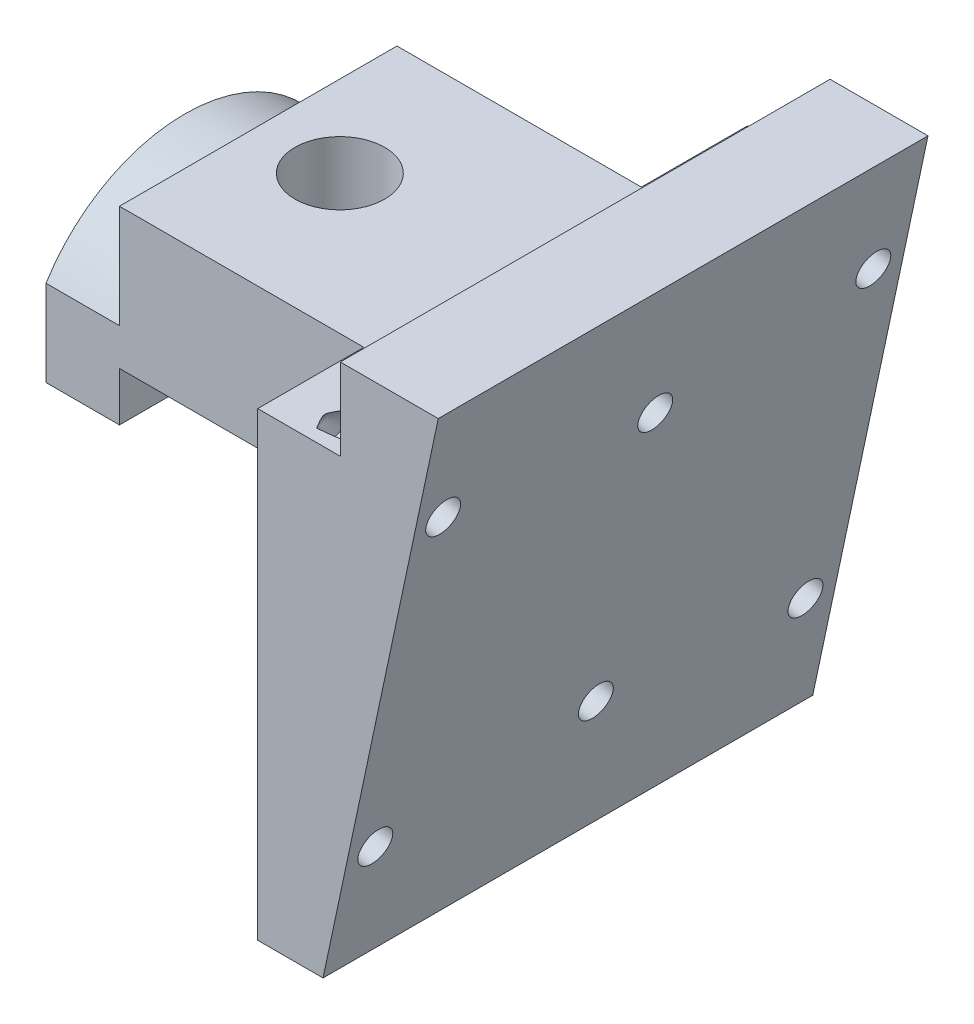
ISO-10303-21;
HEADER;
FILE_DESCRIPTION(('STEP AP214'),'2;1');
FILE_NAME('part.step','',(''),(''),'','','');
FILE_SCHEMA(('AUTOMOTIVE_DESIGN { 1 0 10303 214 1 1 1 1 }'));
ENDSEC;
DATA;
#1=APPLICATION_CONTEXT('core data for automotive mechanical design processes');
#2=APPLICATION_PROTOCOL_DEFINITION('international standard','automotive_design',2000,#1);
#3=PRODUCT_CONTEXT('',#1,'mechanical');
#4=PRODUCT('Part','Part','',(#3));
#5=PRODUCT_RELATED_PRODUCT_CATEGORY('part','',(#4));
#6=PRODUCT_DEFINITION_FORMATION('','',#4);
#7=PRODUCT_DEFINITION_CONTEXT('part definition',#1,'design');
#8=PRODUCT_DEFINITION('design','',#6,#7);
#9=PRODUCT_DEFINITION_SHAPE('','',#8);
#10=(LENGTH_UNIT() NAMED_UNIT(*) SI_UNIT(.MILLI.,.METRE.));
#11=(NAMED_UNIT(*) PLANE_ANGLE_UNIT() SI_UNIT($,.RADIAN.));
#12=(NAMED_UNIT(*) SI_UNIT($,.STERADIAN.) SOLID_ANGLE_UNIT());
#13=UNCERTAINTY_MEASURE_WITH_UNIT(LENGTH_MEASURE(1.E-05),#10,'distance_accuracy_value','');
#14=(GEOMETRIC_REPRESENTATION_CONTEXT(3) GLOBAL_UNCERTAINTY_ASSIGNED_CONTEXT((#13)) GLOBAL_UNIT_ASSIGNED_CONTEXT((#10,
#11,#12)) REPRESENTATION_CONTEXT('',''));
#15=CARTESIAN_POINT('',(0.,0.,0.));
#16=DIRECTION('',(0.,0.,1.));
#17=DIRECTION('',(1.,0.,0.));
#18=AXIS2_PLACEMENT_3D('',#15,#16,#17);
#19=CARTESIAN_POINT('',(106.058601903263,23.2081110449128,30.));
#20=DIRECTION('',(0.,-1.,0.));
#21=DIRECTION('',(0.,0.,-1.));
#22=AXIS2_PLACEMENT_3D('',#19,#20,#21);
#23=PLANE('',#22);
#24=CARTESIAN_POINT('',(76.,23.2081110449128,0.));
#25=DIRECTION('',(0.,1.,0.));
#26=DIRECTION('',(0.,0.,1.));
#27=AXIS2_PLACEMENT_3D('',#24,#25,#26);
#28=CIRCLE('',#27,5.49999999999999);
#29=CARTESIAN_POINT('',(76.,23.2081110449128,5.49999999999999));
#30=VERTEX_POINT('',#29);
#31=EDGE_CURVE('E330',#30,#30,#28,.T.);
#32=ORIENTED_EDGE('',*,*,#31,.F.);
#33=EDGE_LOOP('',(#32));
#34=FACE_BOUND('',#33,.T.);
#35=DIRECTION('',(0.,0.,-1.));
#36=VECTOR('',#35,1.);
#37=CARTESIAN_POINT('',(106.058601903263,23.2081110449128,30.));
#38=LINE('',#37,#36);
#39=CARTESIAN_POINT('',(106.058601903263,23.2081110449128,30.));
#40=VERTEX_POINT('',#39);
#41=CARTESIAN_POINT('',(106.058601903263,23.2081110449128,27.7685099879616));
#42=VERTEX_POINT('',#41);
#43=EDGE_CURVE('E186',#40,#42,#38,.T.);
#44=ORIENTED_EDGE('',*,*,#43,.T.);
#45=CARTESIAN_POINT('',(98.0091088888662,23.2081110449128,26.4999999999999));
#46=DIRECTION('',(0.,-1.,0.));
#47=DIRECTION('',(1.,0.,0.));
#48=AXIS2_PLACEMENT_3D('',#45,#46,#47);
#49=ELLIPSE('',#48,10.1004421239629,2.09999999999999);
#50=CARTESIAN_POINT('',(101.620267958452,23.2081110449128,28.4611976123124));
#51=VERTEX_POINT('',#50);
#52=EDGE_CURVE('E51',#42,#51,#49,.T.);
#53=ORIENTED_EDGE('',*,*,#52,.T.);
#54=CARTESIAN_POINT('',(101.703987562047,23.2081110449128,28.6001999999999));
#55=CARTESIAN_POINT('',(101.657498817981,23.2081110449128,28.5231351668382));
#56=CARTESIAN_POINT('',(101.611091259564,23.2081110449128,28.4460209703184));
#57=CARTESIAN_POINT('',(101.518463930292,23.2081110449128,28.2914900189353));
#58=CARTESIAN_POINT('',(101.472244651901,23.2081110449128,28.2140729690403));
#59=CARTESIAN_POINT('',(101.376601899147,23.2081110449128,28.0529698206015));
#60=CARTESIAN_POINT('',(101.327209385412,23.2081110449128,27.9692652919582));
#61=CARTESIAN_POINT('',(101.229229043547,23.2081110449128,27.8015944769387));
#62=CARTESIAN_POINT('',(101.180639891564,23.2081110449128,27.7176289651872));
#63=CARTESIAN_POINT('',(101.08481873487,23.2081110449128,27.5492901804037));
#64=CARTESIAN_POINT('',(101.037582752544,23.2081110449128,27.4649191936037));
#65=CARTESIAN_POINT('',(100.968346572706,23.2081110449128,27.3371563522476));
#66=CARTESIAN_POINT('',(100.945473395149,23.2081110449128,27.2942412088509));
#67=CARTESIAN_POINT('',(100.900614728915,23.2081110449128,27.2079516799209));
#68=CARTESIAN_POINT('',(100.878629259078,23.2081110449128,27.1645772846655));
#69=CARTESIAN_POINT('',(100.83702303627,23.2081110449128,27.0792265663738));
#70=CARTESIAN_POINT('',(100.817339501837,23.2081110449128,27.0372823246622));
#71=CARTESIAN_POINT('',(100.77990806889,23.2081110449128,26.9525477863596));
#72=CARTESIAN_POINT('',(100.762162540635,23.2081110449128,26.9097565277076));
#73=CARTESIAN_POINT('',(100.713956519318,23.2081110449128,26.7803247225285));
#74=CARTESIAN_POINT('',(100.687919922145,23.2081110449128,26.6915221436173));
#75=CARTESIAN_POINT('',(100.673384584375,23.2081110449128,26.5757783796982));
#76=CARTESIAN_POINT('',(100.671356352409,23.2081110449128,26.5506544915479));
#77=CARTESIAN_POINT('',(100.669725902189,23.2081110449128,26.5003077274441));
#78=CARTESIAN_POINT('',(100.670125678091,23.2081110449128,26.4750847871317));
#79=CARTESIAN_POINT('',(100.67331773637,23.2081110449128,26.4247064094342));
#80=CARTESIAN_POINT('',(100.676118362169,23.2081110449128,26.3995515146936));
#81=CARTESIAN_POINT('',(100.683842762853,23.2081110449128,26.3495812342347));
#82=CARTESIAN_POINT('',(100.688766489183,23.2081110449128,26.3247658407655));
#83=CARTESIAN_POINT('',(100.703654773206,23.2081110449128,26.2614784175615));
#84=CARTESIAN_POINT('',(100.714891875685,23.2081110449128,26.2233101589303));
#85=CARTESIAN_POINT('',(100.740227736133,23.2081110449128,26.1479200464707));
#86=CARTESIAN_POINT('',(100.754330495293,23.2081110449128,26.1106995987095));
#87=CARTESIAN_POINT('',(100.784458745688,23.2081110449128,26.0368687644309));
#88=CARTESIAN_POINT('',(100.800492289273,23.2081110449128,26.000261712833));
#89=CARTESIAN_POINT('',(100.833797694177,23.2081110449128,25.9276474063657));
#90=CARTESIAN_POINT('',(100.8510688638,23.2081110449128,25.891639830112));
#91=CARTESIAN_POINT('',(100.905015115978,23.2081110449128,25.7824483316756));
#92=CARTESIAN_POINT('',(100.943022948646,23.2081110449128,25.7099273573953));
#93=CARTESIAN_POINT('',(101.020667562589,23.2081110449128,25.5660215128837));
#94=CARTESIAN_POINT('',(101.060299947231,23.2081110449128,25.4946342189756));
#95=CARTESIAN_POINT('',(101.150225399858,23.2081110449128,25.3352895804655));
#96=CARTESIAN_POINT('',(101.200786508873,23.2081110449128,25.2474836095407));
#97=CARTESIAN_POINT('',(101.302790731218,23.2081110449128,25.0722837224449));
#98=CARTESIAN_POINT('',(101.354234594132,23.2081110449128,24.9848902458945));
#99=CARTESIAN_POINT('',(101.455262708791,23.2081110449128,24.81441440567));
#100=CARTESIAN_POINT('',(101.504823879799,23.2081110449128,24.7313183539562));
#101=CARTESIAN_POINT('',(101.604223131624,23.2081110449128,24.5653968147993));
#102=CARTESIAN_POINT('',(101.654060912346,23.2081110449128,24.4825711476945));
#103=CARTESIAN_POINT('',(101.703987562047,23.2081110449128,24.3997999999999));
#104=B_SPLINE_CURVE_WITH_KNOTS('',3,(#54,#55,#56,#57,#58,#59,#60,#61,#62,#63,#64,#65,#66,#67,
#68,#69,#70,#71,#72,#73,#74,#75,#76,#77,#78,#79,#80,#81,#82,#83,#84,#85,#86,#87,#88,#89,#90,#91,
#92,#93,#94,#95,#96,#97,#98,#99,#100,#101,#102,#103),.UNSPECIFIED.,.F.,.F.,(4,2,2,2,2,2,2,2,2,2,
2,2,2,2,2,2,2,2,2,2,2,2,2,2,4),(0.,0.270003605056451,0.540496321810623,0.83206650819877,
1.12309530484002,1.41315578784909,1.55903628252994,1.70491987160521,1.84384055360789,
1.9829292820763,2.25732169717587,2.33282083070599,2.40838198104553,2.4842067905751,
2.56002986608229,2.67920400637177,2.79854570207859,2.91840357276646,3.03819497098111,
3.28376658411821,3.5287125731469,3.83267008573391,4.1368999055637,4.42715979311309,
4.71714997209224),.UNSPECIFIED.);
#105=CARTESIAN_POINT('',(101.620267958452,23.2081110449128,24.5388023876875));
#106=VERTEX_POINT('',#105);
#107=EDGE_CURVE('E11',#51,#106,#104,.T.);
#108=ORIENTED_EDGE('',*,*,#107,.T.);
#109=CARTESIAN_POINT('',(106.058601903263,23.2081110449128,25.2314900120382));
#110=VERTEX_POINT('',#109);
#111=EDGE_CURVE('E183',#106,#110,#49,.T.);
#112=ORIENTED_EDGE('',*,*,#111,.T.);
#113=CARTESIAN_POINT('',(106.058601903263,23.2081110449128,-24.9314900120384));
#114=VERTEX_POINT('',#113);
#115=EDGE_CURVE('E59',#110,#114,#38,.T.);
#116=ORIENTED_EDGE('',*,*,#115,.T.);
#117=CARTESIAN_POINT('',(98.0091088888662,23.2081110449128,-26.2000000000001));
#118=DIRECTION('',(0.,-1.,0.));
#119=DIRECTION('',(1.,0.,0.));
#120=AXIS2_PLACEMENT_3D('',#117,#118,#119);
#121=ELLIPSE('',#120,10.1004421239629,2.09999999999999);
#122=CARTESIAN_POINT('',(101.620267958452,23.2081110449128,-24.2388023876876));
#123=VERTEX_POINT('',#122);
#124=EDGE_CURVE('E209',#114,#123,#121,.T.);
#125=ORIENTED_EDGE('',*,*,#124,.T.);
#126=CARTESIAN_POINT('',(101.703987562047,23.2081110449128,-24.0998000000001));
#127=CARTESIAN_POINT('',(101.657498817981,23.2081110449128,-24.1768648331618));
#128=CARTESIAN_POINT('',(101.611091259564,23.2081110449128,-24.2539790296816));
#129=CARTESIAN_POINT('',(101.518463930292,23.2081110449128,-24.4085099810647));
#130=CARTESIAN_POINT('',(101.472244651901,23.2081110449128,-24.4859270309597));
#131=CARTESIAN_POINT('',(101.376601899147,23.2081110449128,-24.6470301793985));
#132=CARTESIAN_POINT('',(101.327209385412,23.2081110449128,-24.7307347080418));
#133=CARTESIAN_POINT('',(101.229229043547,23.2081110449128,-24.8984055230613));
#134=CARTESIAN_POINT('',(101.180639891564,23.2081110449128,-24.9823710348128));
#135=CARTESIAN_POINT('',(101.08481873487,23.2081110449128,-25.1507098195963));
#136=CARTESIAN_POINT('',(101.037582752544,23.2081110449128,-25.2350808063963));
#137=CARTESIAN_POINT('',(100.968346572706,23.2081110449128,-25.3628436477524));
#138=CARTESIAN_POINT('',(100.945473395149,23.2081110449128,-25.4057587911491));
#139=CARTESIAN_POINT('',(100.900614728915,23.2081110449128,-25.4920483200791));
#140=CARTESIAN_POINT('',(100.878629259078,23.2081110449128,-25.5354227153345));
#141=CARTESIAN_POINT('',(100.83702303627,23.2081110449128,-25.6207734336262));
#142=CARTESIAN_POINT('',(100.817339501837,23.2081110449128,-25.6627176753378));
#143=CARTESIAN_POINT('',(100.77990806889,23.2081110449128,-25.7474522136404));
#144=CARTESIAN_POINT('',(100.762162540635,23.2081110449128,-25.7902434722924));
#145=CARTESIAN_POINT('',(100.713956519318,23.2081110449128,-25.9196752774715));
#146=CARTESIAN_POINT('',(100.687919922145,23.2081110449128,-26.0084778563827));
#147=CARTESIAN_POINT('',(100.673384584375,23.2081110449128,-26.1242216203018));
#148=CARTESIAN_POINT('',(100.671356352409,23.2081110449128,-26.1493455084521));
#149=CARTESIAN_POINT('',(100.669725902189,23.2081110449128,-26.1996922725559));
#150=CARTESIAN_POINT('',(100.670125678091,23.2081110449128,-26.2249152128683));
#151=CARTESIAN_POINT('',(100.67331773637,23.2081110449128,-26.2752935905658));
#152=CARTESIAN_POINT('',(100.676118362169,23.2081110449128,-26.3004484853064));
#153=CARTESIAN_POINT('',(100.683842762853,23.2081110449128,-26.3504187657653));
#154=CARTESIAN_POINT('',(100.688766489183,23.2081110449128,-26.3752341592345));
#155=CARTESIAN_POINT('',(100.703654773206,23.2081110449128,-26.4385215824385));
#156=CARTESIAN_POINT('',(100.714891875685,23.2081110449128,-26.4766898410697));
#157=CARTESIAN_POINT('',(100.740227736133,23.2081110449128,-26.5520799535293));
#158=CARTESIAN_POINT('',(100.754330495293,23.2081110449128,-26.5893004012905));
#159=CARTESIAN_POINT('',(100.784458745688,23.2081110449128,-26.6631312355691));
#160=CARTESIAN_POINT('',(100.800492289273,23.2081110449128,-26.699738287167));
#161=CARTESIAN_POINT('',(100.833797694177,23.2081110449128,-26.7723525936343));
#162=CARTESIAN_POINT('',(100.8510688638,23.2081110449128,-26.808360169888));
#163=CARTESIAN_POINT('',(100.905015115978,23.2081110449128,-26.9175516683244));
#164=CARTESIAN_POINT('',(100.943022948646,23.2081110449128,-26.9900726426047));
#165=CARTESIAN_POINT('',(101.020667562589,23.2081110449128,-27.1339784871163));
#166=CARTESIAN_POINT('',(101.060299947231,23.2081110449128,-27.2053657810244));
#167=CARTESIAN_POINT('',(101.150225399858,23.2081110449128,-27.3647104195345));
#168=CARTESIAN_POINT('',(101.200786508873,23.2081110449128,-27.4525163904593));
#169=CARTESIAN_POINT('',(101.302790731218,23.2081110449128,-27.6277162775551));
#170=CARTESIAN_POINT('',(101.354234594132,23.2081110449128,-27.7151097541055));
#171=CARTESIAN_POINT('',(101.455262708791,23.2081110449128,-27.88558559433));
#172=CARTESIAN_POINT('',(101.504823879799,23.2081110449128,-27.9686816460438));
#173=CARTESIAN_POINT('',(101.604223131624,23.2081110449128,-28.1346031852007));
#174=CARTESIAN_POINT('',(101.654060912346,23.2081110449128,-28.2174288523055));
#175=CARTESIAN_POINT('',(101.703987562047,23.2081110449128,-28.3002000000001));
#176=B_SPLINE_CURVE_WITH_KNOTS('',3,(#126,#127,#128,#129,#130,#131,#132,#133,#134,#135,#136,
#137,#138,#139,#140,#141,#142,#143,#144,#145,#146,#147,#148,#149,#150,#151,#152,#153,#154,#155,
#156,#157,#158,#159,#160,#161,#162,#163,#164,#165,#166,#167,#168,#169,#170,#171,#172,#173,#174,
#175),.UNSPECIFIED.,.F.,.F.,(4,2,2,2,2,2,2,2,2,2,2,2,2,2,2,2,2,2,2,2,2,2,2,2,4),(0.,
0.270003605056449,0.54049632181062,0.832066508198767,1.12309530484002,1.41315578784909,
1.55903628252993,1.70491987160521,1.84384055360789,1.9829292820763,2.25732169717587,
2.332820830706,2.40838198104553,2.4842067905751,2.56002986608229,2.67920400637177,
2.79854570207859,2.91840357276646,3.03819497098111,3.2837665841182,3.5287125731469,
3.83267008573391,4.1368999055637,4.42715979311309,4.71714997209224),.UNSPECIFIED.);
#177=CARTESIAN_POINT('',(101.620267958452,23.2081110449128,-28.1611976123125));
#178=VERTEX_POINT('',#177);
#179=EDGE_CURVE('E250',#123,#178,#176,.T.);
#180=ORIENTED_EDGE('',*,*,#179,.T.);
#181=CARTESIAN_POINT('',(106.058601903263,23.2081110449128,-27.4685099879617));
#182=VERTEX_POINT('',#181);
#183=EDGE_CURVE('E206',#178,#182,#121,.T.);
#184=ORIENTED_EDGE('',*,*,#183,.T.);
#185=CARTESIAN_POINT('',(106.058601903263,23.2081110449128,-30.));
#186=VERTEX_POINT('',#185);
#187=EDGE_CURVE('E436',#182,#186,#38,.T.);
#188=ORIENTED_EDGE('',*,*,#187,.T.);
#189=DIRECTION('',(-1.,0.,0.));
#190=VECTOR('',#189,1.);
#191=CARTESIAN_POINT('',(106.058601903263,23.2081110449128,-30.));
#192=LINE('',#191,#190);
#193=CARTESIAN_POINT('',(95.9413980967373,23.2081110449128,-30.));
#194=VERTEX_POINT('',#193);
#195=EDGE_CURVE('E402',#186,#194,#192,.T.);
#196=ORIENTED_EDGE('',*,*,#195,.T.);
#197=DIRECTION('',(0.,0.,-1.));
#198=VECTOR('',#197,1.);
#199=CARTESIAN_POINT('',(95.9413980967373,23.2081110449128,30.));
#200=LINE('',#199,#198);
#201=CARTESIAN_POINT('',(95.9413980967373,23.2081110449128,-17.));
#202=VERTEX_POINT('',#201);
#203=EDGE_CURVE('E425',#202,#194,#200,.T.);
#204=ORIENTED_EDGE('',*,*,#203,.F.);
#205=DIRECTION('',(-1.,0.,0.));
#206=VECTOR('',#205,1.);
#207=CARTESIAN_POINT('',(95.9413980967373,23.2081110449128,-17.));
#208=LINE('',#207,#206);
#209=CARTESIAN_POINT('',(66.,23.2081110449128,-17.));
#210=VERTEX_POINT('',#209);
#211=EDGE_CURVE('E234',#202,#210,#208,.T.);
#212=ORIENTED_EDGE('',*,*,#211,.T.);
#213=DIRECTION('',(0.,0.,-1.));
#214=VECTOR('',#213,1.);
#215=CARTESIAN_POINT('',(66.,23.2081110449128,30.));
#216=LINE('',#215,#214);
#217=CARTESIAN_POINT('',(66.,23.2081110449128,17.));
#218=VERTEX_POINT('',#217);
#219=EDGE_CURVE('E218',#218,#210,#216,.T.);
#220=ORIENTED_EDGE('',*,*,#219,.F.);
#221=DIRECTION('',(-1.,0.,0.));
#222=VECTOR('',#221,1.);
#223=CARTESIAN_POINT('',(95.9413980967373,23.2081110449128,17.));
#224=LINE('',#223,#222);
#225=CARTESIAN_POINT('',(95.9413980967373,23.2081110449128,17.));
#226=VERTEX_POINT('',#225);
#227=EDGE_CURVE('E453',#226,#218,#224,.T.);
#228=ORIENTED_EDGE('',*,*,#227,.F.);
#229=CARTESIAN_POINT('',(95.9413980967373,23.2081110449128,30.));
#230=VERTEX_POINT('',#229);
#231=EDGE_CURVE('E433',#230,#226,#200,.T.);
#232=ORIENTED_EDGE('',*,*,#231,.F.);
#233=DIRECTION('',(-1.,0.,0.));
#234=VECTOR('',#233,1.);
#235=CARTESIAN_POINT('',(106.058601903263,23.2081110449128,30.));
#236=LINE('',#235,#234);
#237=EDGE_CURVE('E418',#40,#230,#236,.T.);
#238=ORIENTED_EDGE('',*,*,#237,.F.);
#239=EDGE_LOOP('',(#44,#53,#108,#112,#116,#125,#180,#184,#188,#196,#204,#212,#220,#228,#232,#238));
#240=FACE_BOUND('',#239,.T.);
#241=ADVANCED_FACE('F34',(#34,#240),#23,.F.);
#242=CARTESIAN_POINT('',(57.,23.2081110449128,17.));
#243=DIRECTION('',(1.,0.,0.));
#244=DIRECTION('',(0.,0.,-1.));
#245=AXIS2_PLACEMENT_3D('',#242,#243,#244);
#246=PLANE('',#245);
#247=CARTESIAN_POINT('',(57.,0.,0.));
#248=DIRECTION('',(-1.,0.,0.));
#249=DIRECTION('',(0.,0.,1.));
#250=AXIS2_PLACEMENT_3D('',#247,#248,#249);
#251=CIRCLE('',#250,20.);
#252=CARTESIAN_POINT('',(57.,10.5356537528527,17.));
#253=VERTEX_POINT('',#252);
#254=CARTESIAN_POINT('',(57.,10.5356537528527,-17.));
#255=VERTEX_POINT('',#254);
#256=EDGE_CURVE('E210',#253,#255,#251,.T.);
#257=ORIENTED_EDGE('',*,*,#256,.T.);
#258=DIRECTION('',(0.,-1.,0.));
#259=VECTOR('',#258,1.);
#260=CARTESIAN_POINT('',(57.,23.2081110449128,-17.));
#261=LINE('',#260,#259);
#262=CARTESIAN_POINT('',(57.,0.,-17.));
#263=VERTEX_POINT('',#262);
#264=EDGE_CURVE('E228',#255,#263,#261,.T.);
#265=ORIENTED_EDGE('',*,*,#264,.T.);
#266=DIRECTION('',(0.,0.,-1.));
#267=VECTOR('',#266,1.);
#268=CARTESIAN_POINT('',(57.,0.,17.));
#269=LINE('',#268,#267);
#270=CARTESIAN_POINT('',(57.,0.,17.));
#271=VERTEX_POINT('',#270);
#272=EDGE_CURVE('E476',#271,#263,#269,.T.);
#273=ORIENTED_EDGE('',*,*,#272,.F.);
#274=DIRECTION('',(0.,-1.,0.));
#275=VECTOR('',#274,1.);
#276=CARTESIAN_POINT('',(57.,23.2081110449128,17.));
#277=LINE('',#276,#275);
#278=EDGE_CURVE('E454',#253,#271,#277,.T.);
#279=ORIENTED_EDGE('',*,*,#278,.F.);
#280=EDGE_LOOP('',(#257,#265,#273,#279));
#281=FACE_BOUND('',#280,.T.);
#282=ADVANCED_FACE('F290',(#281),#246,.F.);
#283=CARTESIAN_POINT('',(95.9413980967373,6.,17.));
#284=DIRECTION('',(0.,0.,1.));
#285=DIRECTION('',(1.,0.,0.));
#286=AXIS2_PLACEMENT_3D('',#283,#284,#285);
#287=PLANE('',#286);
#288=ORIENTED_EDGE('',*,*,#227,.T.);
#289=DIRECTION('',(0.,-1.,0.));
#290=VECTOR('',#289,1.);
#291=CARTESIAN_POINT('',(66.,6.,17.));
#292=LINE('',#291,#290);
#293=CARTESIAN_POINT('',(66.,10.5356537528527,17.));
#294=VERTEX_POINT('',#293);
#295=EDGE_CURVE('E220',#218,#294,#292,.T.);
#296=ORIENTED_EDGE('',*,*,#295,.T.);
#297=DIRECTION('',(-1.,0.,0.));
#298=VECTOR('',#297,1.);
#299=CARTESIAN_POINT('',(66.,10.5356537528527,17.));
#300=LINE('',#299,#298);
#301=EDGE_CURVE('E215',#294,#253,#300,.T.);
#302=ORIENTED_EDGE('',*,*,#301,.T.);
#303=ORIENTED_EDGE('',*,*,#278,.T.);
#304=DIRECTION('',(1.,0.,0.));
#305=VECTOR('',#304,1.);
#306=CARTESIAN_POINT('',(57.,0.,17.));
#307=LINE('',#306,#305);
#308=CARTESIAN_POINT('',(66.,0.,17.));
#309=VERTEX_POINT('',#308);
#310=EDGE_CURVE('E455',#271,#309,#307,.T.);
#311=ORIENTED_EDGE('',*,*,#310,.T.);
#312=DIRECTION('',(0.,1.,0.));
#313=VECTOR('',#312,1.);
#314=CARTESIAN_POINT('',(66.,0.,17.));
#315=LINE('',#314,#313);
#316=CARTESIAN_POINT('',(66.,6.,17.));
#317=VERTEX_POINT('',#316);
#318=EDGE_CURVE('E468',#309,#317,#315,.T.);
#319=ORIENTED_EDGE('',*,*,#318,.T.);
#320=DIRECTION('',(1.,0.,0.));
#321=VECTOR('',#320,1.);
#322=CARTESIAN_POINT('',(66.,6.,17.));
#323=LINE('',#322,#321);
#324=CARTESIAN_POINT('',(95.9413980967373,6.,17.));
#325=VERTEX_POINT('',#324);
#326=EDGE_CURVE('E457',#317,#325,#323,.T.);
#327=ORIENTED_EDGE('',*,*,#326,.T.);
#328=DIRECTION('',(0.,1.,0.));
#329=VECTOR('',#328,1.);
#330=CARTESIAN_POINT('',(95.9413980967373,6.,17.));
#331=LINE('',#330,#329);
#332=EDGE_CURVE('E449',#325,#226,#331,.T.);
#333=ORIENTED_EDGE('',*,*,#332,.T.);
#334=EDGE_LOOP('',(#288,#296,#302,#303,#311,#319,#327,#333));
#335=FACE_BOUND('',#334,.T.);
#336=ADVANCED_FACE('F286',(#335),#287,.T.);
#337=CARTESIAN_POINT('',(95.9413980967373,6.,-17.));
#338=DIRECTION('',(0.,0.,1.));
#339=DIRECTION('',(1.,0.,0.));
#340=AXIS2_PLACEMENT_3D('',#337,#338,#339);
#341=PLANE('',#340);
#342=DIRECTION('',(0.,-1.,0.));
#343=VECTOR('',#342,1.);
#344=CARTESIAN_POINT('',(66.,6.,-17.));
#345=LINE('',#344,#343);
#346=CARTESIAN_POINT('',(66.,10.5356537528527,-17.));
#347=VERTEX_POINT('',#346);
#348=EDGE_CURVE('E243',#210,#347,#345,.T.);
#349=ORIENTED_EDGE('',*,*,#348,.F.);
#350=ORIENTED_EDGE('',*,*,#211,.F.);
#351=DIRECTION('',(0.,1.,0.));
#352=VECTOR('',#351,1.);
#353=CARTESIAN_POINT('',(95.9413980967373,6.,-17.));
#354=LINE('',#353,#352);
#355=CARTESIAN_POINT('',(95.9413980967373,6.,-17.));
#356=VERTEX_POINT('',#355);
#357=EDGE_CURVE('E225',#356,#202,#354,.T.);
#358=ORIENTED_EDGE('',*,*,#357,.F.);
#359=DIRECTION('',(1.,0.,0.));
#360=VECTOR('',#359,1.);
#361=CARTESIAN_POINT('',(66.,6.,-17.));
#362=LINE('',#361,#360);
#363=CARTESIAN_POINT('',(66.,6.,-17.));
#364=VERTEX_POINT('',#363);
#365=EDGE_CURVE('E223',#364,#356,#362,.T.);
#366=ORIENTED_EDGE('',*,*,#365,.F.);
#367=DIRECTION('',(0.,1.,0.));
#368=VECTOR('',#367,1.);
#369=CARTESIAN_POINT('',(66.,0.,-17.));
#370=LINE('',#369,#368);
#371=CARTESIAN_POINT('',(66.,0.,-17.));
#372=VERTEX_POINT('',#371);
#373=EDGE_CURVE('E460',#372,#364,#370,.T.);
#374=ORIENTED_EDGE('',*,*,#373,.F.);
#375=DIRECTION('',(1.,0.,0.));
#376=VECTOR('',#375,1.);
#377=CARTESIAN_POINT('',(57.,0.,-17.));
#378=LINE('',#377,#376);
#379=EDGE_CURVE('E464',#263,#372,#378,.T.);
#380=ORIENTED_EDGE('',*,*,#379,.F.);
#381=ORIENTED_EDGE('',*,*,#264,.F.);
#382=DIRECTION('',(-1.,0.,0.));
#383=VECTOR('',#382,1.);
#384=CARTESIAN_POINT('',(66.,10.5356537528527,-17.));
#385=LINE('',#384,#383);
#386=EDGE_CURVE('E241',#347,#255,#385,.T.);
#387=ORIENTED_EDGE('',*,*,#386,.F.);
#388=EDGE_LOOP('',(#349,#350,#358,#366,#374,#380,#381,#387));
#389=FACE_BOUND('',#388,.T.);
#390=ADVANCED_FACE('F283',(#389),#341,.F.);
#391=CARTESIAN_POINT('',(95.9413980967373,-33.2081110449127,30.));
#392=DIRECTION('',(0.,1.,0.));
#393=DIRECTION('',(0.,0.,1.));
#394=AXIS2_PLACEMENT_3D('',#391,#392,#393);
#395=PLANE('',#394);
#396=DIRECTION('',(1.,0.,0.));
#397=VECTOR('',#396,1.);
#398=CARTESIAN_POINT('',(95.9413980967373,-33.2081110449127,-30.));
#399=LINE('',#398,#397);
#400=CARTESIAN_POINT('',(95.9413980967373,-33.2081110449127,-30.));
#401=VERTEX_POINT('',#400);
#402=CARTESIAN_POINT('',(103.941398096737,-33.2081110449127,-30.));
#403=VERTEX_POINT('',#402);
#404=EDGE_CURVE('E389',#401,#403,#399,.T.);
#405=ORIENTED_EDGE('',*,*,#404,.T.);
#406=DIRECTION('',(0.,0.,-1.));
#407=VECTOR('',#406,1.);
#408=CARTESIAN_POINT('',(103.941398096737,-33.2081110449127,30.));
#409=LINE('',#408,#407);
#410=CARTESIAN_POINT('',(103.941398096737,-33.2081110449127,30.));
#411=VERTEX_POINT('',#410);
#412=EDGE_CURVE('E244',#411,#403,#409,.T.);
#413=ORIENTED_EDGE('',*,*,#412,.F.);
#414=DIRECTION('',(1.,0.,0.));
#415=VECTOR('',#414,1.);
#416=CARTESIAN_POINT('',(95.9413980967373,-33.2081110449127,30.));
#417=LINE('',#416,#415);
#418=CARTESIAN_POINT('',(95.9413980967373,-33.2081110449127,30.));
#419=VERTEX_POINT('',#418);
#420=EDGE_CURVE('E410',#419,#411,#417,.T.);
#421=ORIENTED_EDGE('',*,*,#420,.F.);
#422=DIRECTION('',(0.,0.,-1.));
#423=VECTOR('',#422,1.);
#424=CARTESIAN_POINT('',(95.9413980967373,-33.2081110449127,30.));
#425=LINE('',#424,#423);
#426=EDGE_CURVE('E422',#419,#401,#425,.T.);
#427=ORIENTED_EDGE('',*,*,#426,.T.);
#428=EDGE_LOOP('',(#405,#413,#421,#427));
#429=FACE_BOUND('',#428,.T.);
#430=ADVANCED_FACE('F36',(#429),#395,.F.);
#431=CARTESIAN_POINT('',(103.941398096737,-33.2081110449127,30.));
#432=DIRECTION('',(-0.978147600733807,0.207911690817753,0.));
#433=DIRECTION('',(-0.207911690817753,-0.978147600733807,0.));
#434=AXIS2_PLACEMENT_3D('',#431,#432,#433);
#435=PLANE('',#434);
#436=CARTESIAN_POINT('',(106.841766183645,-19.5629520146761,-26.2));
#437=DIRECTION('',(0.978147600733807,-0.207911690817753,0.));
#438=DIRECTION('',(0.207911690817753,0.978147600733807,0.));
#439=AXIS2_PLACEMENT_3D('',#436,#437,#438);
#440=CIRCLE('',#439,2.09999999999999);
#441=CARTESIAN_POINT('',(107.278380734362,-17.5088420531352,-26.2));
#442=VERTEX_POINT('',#441);
#443=EDGE_CURVE('E334',#442,#442,#440,.T.);
#444=ORIENTED_EDGE('',*,*,#443,.F.);
#445=EDGE_LOOP('',(#444));
#446=FACE_BOUND('',#445,.T.);
#447=CARTESIAN_POINT('',(106.841766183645,-19.5629520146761,26.5));
#448=DIRECTION('',(0.978147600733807,-0.207911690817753,0.));
#449=DIRECTION('',(0.207911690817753,0.978147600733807,0.));
#450=AXIS2_PLACEMENT_3D('',#447,#448,#449);
#451=CIRCLE('',#450,2.09999999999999);
#452=CARTESIAN_POINT('',(107.278380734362,-17.5088420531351,26.5));
#453=VERTEX_POINT('',#452);
#454=EDGE_CURVE('E339',#453,#453,#451,.T.);
#455=ORIENTED_EDGE('',*,*,#454,.F.);
#456=EDGE_LOOP('',(#455));
#457=FACE_BOUND('',#456,.T.);
#458=CARTESIAN_POINT('',(115.158233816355,19.5629520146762,26.4999999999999));
#459=DIRECTION('',(0.978147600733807,-0.207911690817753,0.));
#460=DIRECTION('',(0.207911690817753,0.978147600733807,0.));
#461=AXIS2_PLACEMENT_3D('',#458,#459,#460);
#462=CIRCLE('',#461,2.09999999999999);
#463=CARTESIAN_POINT('',(115.594848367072,21.6170619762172,26.4999999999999));
#464=VERTEX_POINT('',#463);
#465=EDGE_CURVE('E179',#464,#464,#462,.T.);
#466=ORIENTED_EDGE('',*,*,#465,.F.);
#467=EDGE_LOOP('',(#466));
#468=FACE_BOUND('',#467,.T.);
#469=CARTESIAN_POINT('',(114.638454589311,17.1175830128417,0.));
#470=DIRECTION('',(0.978147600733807,-0.207911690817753,0.));
#471=DIRECTION('',(0.207911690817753,0.978147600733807,0.));
#472=AXIS2_PLACEMENT_3D('',#469,#470,#471);
#473=CIRCLE('',#472,2.09999999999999);
#474=CARTESIAN_POINT('',(115.075069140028,19.1716929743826,0.));
#475=VERTEX_POINT('',#474);
#476=EDGE_CURVE('E190',#475,#475,#473,.T.);
#477=ORIENTED_EDGE('',*,*,#476,.F.);
#478=EDGE_LOOP('',(#477));
#479=FACE_BOUND('',#478,.T.);
#480=CARTESIAN_POINT('',(107.361545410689,-17.1175830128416,0.));
#481=DIRECTION('',(0.978147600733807,-0.207911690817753,0.));
#482=DIRECTION('',(0.207911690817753,0.978147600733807,0.));
#483=AXIS2_PLACEMENT_3D('',#480,#481,#482);
#484=CIRCLE('',#483,2.09999999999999);
#485=CARTESIAN_POINT('',(107.798159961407,-15.0634730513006,0.));
#486=VERTEX_POINT('',#485);
#487=EDGE_CURVE('E196',#486,#486,#484,.T.);
#488=ORIENTED_EDGE('',*,*,#487,.F.);
#489=EDGE_LOOP('',(#488));
#490=FACE_BOUND('',#489,.T.);
#491=CARTESIAN_POINT('',(115.158233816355,19.5629520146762,-26.2000000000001));
#492=DIRECTION('',(0.978147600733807,-0.207911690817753,0.));
#493=DIRECTION('',(0.207911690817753,0.978147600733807,0.));
#494=AXIS2_PLACEMENT_3D('',#491,#492,#493);
#495=CIRCLE('',#494,2.09999999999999);
#496=CARTESIAN_POINT('',(115.594848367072,21.6170619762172,-26.2000000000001));
#497=VERTEX_POINT('',#496);
#498=EDGE_CURVE('E203',#497,#497,#495,.T.);
#499=ORIENTED_EDGE('',*,*,#498,.F.);
#500=EDGE_LOOP('',(#499));
#501=FACE_BOUND('',#500,.T.);
#502=DIRECTION('',(0.207911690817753,0.978147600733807,0.));
#503=VECTOR('',#502,1.);
#504=CARTESIAN_POINT('',(103.941398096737,-33.2081110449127,-30.));
#505=LINE('',#504,#503);
#506=CARTESIAN_POINT('',(118.058601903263,33.2081110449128,-30.));
#507=VERTEX_POINT('',#506);
#508=EDGE_CURVE('E380',#403,#507,#505,.T.);
#509=ORIENTED_EDGE('',*,*,#508,.T.);
#510=DIRECTION('',(0.,0.,-1.));
#511=VECTOR('',#510,1.);
#512=CARTESIAN_POINT('',(118.058601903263,33.2081110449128,30.));
#513=LINE('',#512,#511);
#514=CARTESIAN_POINT('',(118.058601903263,33.2081110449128,30.));
#515=VERTEX_POINT('',#514);
#516=EDGE_CURVE('E382',#515,#507,#513,.T.);
#517=ORIENTED_EDGE('',*,*,#516,.F.);
#518=DIRECTION('',(0.207911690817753,0.978147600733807,0.));
#519=VECTOR('',#518,1.);
#520=CARTESIAN_POINT('',(103.941398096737,-33.2081110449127,30.));
#521=LINE('',#520,#519);
#522=EDGE_CURVE('E413',#411,#515,#521,.T.);
#523=ORIENTED_EDGE('',*,*,#522,.F.);
#524=ORIENTED_EDGE('',*,*,#412,.T.);
#525=EDGE_LOOP('',(#509,#517,#523,#524));
#526=FACE_BOUND('',#525,.T.);
#527=ADVANCED_FACE('F370',(#446,#457,#468,#479,#490,#501,#526),#435,.F.);
#528=CARTESIAN_POINT('',(118.058601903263,33.2081110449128,30.));
#529=DIRECTION('',(0.,-1.,0.));
#530=DIRECTION('',(0.,0.,-1.));
#531=AXIS2_PLACEMENT_3D('',#528,#529,#530);
#532=PLANE('',#531);
#533=DIRECTION('',(-1.,0.,0.));
#534=VECTOR('',#533,1.);
#535=CARTESIAN_POINT('',(118.058601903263,33.2081110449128,-30.));
#536=LINE('',#535,#534);
#537=CARTESIAN_POINT('',(106.058601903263,33.2081110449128,-30.));
#538=VERTEX_POINT('',#537);
#539=EDGE_CURVE('E388',#507,#538,#536,.T.);
#540=ORIENTED_EDGE('',*,*,#539,.T.);
#541=DIRECTION('',(0.,0.,-1.));
#542=VECTOR('',#541,1.);
#543=CARTESIAN_POINT('',(106.058601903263,33.2081110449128,30.));
#544=LINE('',#543,#542);
#545=CARTESIAN_POINT('',(106.058601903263,33.2081110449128,30.));
#546=VERTEX_POINT('',#545);
#547=EDGE_CURVE('E395',#546,#538,#544,.T.);
#548=ORIENTED_EDGE('',*,*,#547,.F.);
#549=DIRECTION('',(-1.,0.,0.));
#550=VECTOR('',#549,1.);
#551=CARTESIAN_POINT('',(118.058601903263,33.2081110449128,30.));
#552=LINE('',#551,#550);
#553=EDGE_CURVE('E394',#515,#546,#552,.T.);
#554=ORIENTED_EDGE('',*,*,#553,.F.);
#555=ORIENTED_EDGE('',*,*,#516,.T.);
#556=EDGE_LOOP('',(#540,#548,#554,#555));
#557=FACE_BOUND('',#556,.T.);
#558=ADVANCED_FACE('F320',(#557),#532,.F.);
#559=CARTESIAN_POINT('',(106.058601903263,33.2081110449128,30.));
#560=DIRECTION('',(1.,0.,0.));
#561=DIRECTION('',(0.,0.,-1.));
#562=AXIS2_PLACEMENT_3D('',#559,#560,#561);
#563=PLANE('',#562);
#564=ORIENTED_EDGE('',*,*,#115,.F.);
#565=CARTESIAN_POINT('',(106.058601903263,21.4971384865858,26.4999999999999));
#566=DIRECTION('',(1.,0.,0.));
#567=DIRECTION('',(0.,-1.,0.));
#568=AXIS2_PLACEMENT_3D('',#565,#566,#567);
#569=ELLIPSE('',#568,2.14691524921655,2.09999999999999);
#570=EDGE_CURVE('E43',#110,#42,#569,.T.);
#571=ORIENTED_EDGE('',*,*,#570,.T.);
#572=ORIENTED_EDGE('',*,*,#43,.F.);
#573=DIRECTION('',(0.,-1.,0.));
#574=VECTOR('',#573,1.);
#575=CARTESIAN_POINT('',(106.058601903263,33.2081110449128,30.));
#576=LINE('',#575,#574);
#577=EDGE_CURVE('E416',#546,#40,#576,.T.);
#578=ORIENTED_EDGE('',*,*,#577,.F.);
#579=ORIENTED_EDGE('',*,*,#547,.T.);
#580=DIRECTION('',(0.,-1.,0.));
#581=VECTOR('',#580,1.);
#582=CARTESIAN_POINT('',(106.058601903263,33.2081110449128,-30.));
#583=LINE('',#582,#581);
#584=EDGE_CURVE('E400',#538,#186,#583,.T.);
#585=ORIENTED_EDGE('',*,*,#584,.T.);
#586=ORIENTED_EDGE('',*,*,#187,.F.);
#587=CARTESIAN_POINT('',(106.058601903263,21.4971384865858,-26.2000000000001));
#588=DIRECTION('',(1.,0.,0.));
#589=DIRECTION('',(0.,-1.,0.));
#590=AXIS2_PLACEMENT_3D('',#587,#588,#589);
#591=ELLIPSE('',#590,2.14691524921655,2.09999999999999);
#592=EDGE_CURVE('E247',#182,#114,#591,.T.);
#593=ORIENTED_EDGE('',*,*,#592,.T.);
#594=EDGE_LOOP('',(#564,#571,#572,#578,#579,#585,#586,#593));
#595=FACE_BOUND('',#594,.T.);
#596=ADVANCED_FACE('F315',(#595),#563,.F.);
#597=CARTESIAN_POINT('',(95.9413980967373,23.2081110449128,30.));
#598=DIRECTION('',(1.,0.,0.));
#599=DIRECTION('',(0.,0.,-1.));
#600=AXIS2_PLACEMENT_3D('',#597,#598,#599);
#601=PLANE('',#600);
#602=CARTESIAN_POINT('',(95.9413980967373,-17.2460072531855,-26.2));
#603=DIRECTION('',(1.,0.,0.));
#604=DIRECTION('',(0.,-1.,0.));
#605=AXIS2_PLACEMENT_3D('',#602,#603,#604);
#606=ELLIPSE('',#605,2.14691524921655,2.09999999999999);
#607=CARTESIAN_POINT('',(95.9413980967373,-19.392922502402,-26.2));
#608=VERTEX_POINT('',#607);
#609=EDGE_CURVE('E338',#608,#608,#606,.T.);
#610=ORIENTED_EDGE('',*,*,#609,.T.);
#611=EDGE_LOOP('',(#610));
#612=FACE_BOUND('',#611,.T.);
#613=CARTESIAN_POINT('',(95.9413980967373,-17.2460072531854,26.5));
#614=DIRECTION('',(1.,0.,0.));
#615=DIRECTION('',(0.,-1.,0.));
#616=AXIS2_PLACEMENT_3D('',#613,#614,#615);
#617=ELLIPSE('',#616,2.14691524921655,2.09999999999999);
#618=CARTESIAN_POINT('',(95.9413980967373,-19.392922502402,26.5));
#619=VERTEX_POINT('',#618);
#620=EDGE_CURVE('E180',#619,#619,#617,.T.);
#621=ORIENTED_EDGE('',*,*,#620,.T.);
#622=EDGE_LOOP('',(#621));
#623=FACE_BOUND('',#622,.T.);
#624=CARTESIAN_POINT('',(95.9413980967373,-14.6901557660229,0.));
#625=DIRECTION('',(1.,0.,0.));
#626=DIRECTION('',(0.,-1.,0.));
#627=AXIS2_PLACEMENT_3D('',#624,#625,#626);
#628=ELLIPSE('',#627,2.14691524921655,2.09999999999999);
#629=CARTESIAN_POINT('',(95.9413980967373,-16.8370710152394,0.));
#630=VERTEX_POINT('',#629);
#631=EDGE_CURVE('E199',#630,#630,#628,.T.);
#632=ORIENTED_EDGE('',*,*,#631,.T.);
#633=EDGE_LOOP('',(#632));
#634=FACE_BOUND('',#633,.T.);
#635=DIRECTION('',(0.,0.,-1.));
#636=VECTOR('',#635,1.);
#637=CARTESIAN_POINT('',(95.9413980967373,6.,17.));
#638=LINE('',#637,#636);
#639=EDGE_CURVE('E479',#325,#356,#638,.T.);
#640=ORIENTED_EDGE('',*,*,#639,.T.);
#641=ORIENTED_EDGE('',*,*,#357,.T.);
#642=ORIENTED_EDGE('',*,*,#203,.T.);
#643=DIRECTION('',(0.,-1.,0.));
#644=VECTOR('',#643,1.);
#645=CARTESIAN_POINT('',(95.9413980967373,23.2081110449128,-30.));
#646=LINE('',#645,#644);
#647=EDGE_CURVE('E408',#194,#401,#646,.T.);
#648=ORIENTED_EDGE('',*,*,#647,.T.);
#649=ORIENTED_EDGE('',*,*,#426,.F.);
#650=DIRECTION('',(0.,-1.,0.));
#651=VECTOR('',#650,1.);
#652=CARTESIAN_POINT('',(95.9413980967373,23.2081110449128,30.));
#653=LINE('',#652,#651);
#654=EDGE_CURVE('E420',#230,#419,#653,.T.);
#655=ORIENTED_EDGE('',*,*,#654,.F.);
#656=ORIENTED_EDGE('',*,*,#231,.T.);
#657=ORIENTED_EDGE('',*,*,#332,.F.);
#658=EDGE_LOOP('',(#640,#641,#642,#648,#649,#655,#656,#657));
#659=FACE_BOUND('',#658,.T.);
#660=ADVANCED_FACE('F312',(#612,#623,#634,#659),#601,.F.);
#661=CARTESIAN_POINT('',(106.058601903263,-33.2081110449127,30.));
#662=DIRECTION('',(0.,0.,-1.));
#663=DIRECTION('',(-1.,0.,0.));
#664=AXIS2_PLACEMENT_3D('',#661,#662,#663);
#665=PLANE('',#664);
#666=ORIENTED_EDGE('',*,*,#420,.T.);
#667=ORIENTED_EDGE('',*,*,#522,.T.);
#668=ORIENTED_EDGE('',*,*,#553,.T.);
#669=ORIENTED_EDGE('',*,*,#577,.T.);
#670=ORIENTED_EDGE('',*,*,#237,.T.);
#671=ORIENTED_EDGE('',*,*,#654,.T.);
#672=EDGE_LOOP('',(#666,#667,#668,#669,#670,#671));
#673=FACE_BOUND('',#672,.T.);
#674=ADVANCED_FACE('F309',(#673),#665,.F.);
#675=CARTESIAN_POINT('',(106.058601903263,-33.2081110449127,-30.));
#676=DIRECTION('',(0.,0.,-1.));
#677=DIRECTION('',(-1.,0.,0.));
#678=AXIS2_PLACEMENT_3D('',#675,#676,#677);
#679=PLANE('',#678);
#680=ORIENTED_EDGE('',*,*,#404,.F.);
#681=ORIENTED_EDGE('',*,*,#647,.F.);
#682=ORIENTED_EDGE('',*,*,#195,.F.);
#683=ORIENTED_EDGE('',*,*,#584,.F.);
#684=ORIENTED_EDGE('',*,*,#539,.F.);
#685=ORIENTED_EDGE('',*,*,#508,.F.);
#686=EDGE_LOOP('',(#680,#681,#682,#683,#684,#685));
#687=FACE_BOUND('',#686,.T.);
#688=ADVANCED_FACE('F305',(#687),#679,.T.);
#689=CARTESIAN_POINT('',(66.,6.,17.));
#690=DIRECTION('',(0.,1.,0.));
#691=DIRECTION('',(-1.,0.,0.));
#692=AXIS2_PLACEMENT_3D('',#689,#690,#691);
#693=PLANE('',#692);
#694=CARTESIAN_POINT('',(76.,6.,0.));
#695=DIRECTION('',(0.,1.,0.));
#696=DIRECTION('',(-1.,0.,0.));
#697=AXIS2_PLACEMENT_3D('',#694,#695,#696);
#698=CIRCLE('',#697,5.49999999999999);
#699=CARTESIAN_POINT('',(70.5,6.,0.));
#700=VERTEX_POINT('',#699);
#701=EDGE_CURVE('E38',#700,#700,#698,.T.);
#702=ORIENTED_EDGE('',*,*,#701,.T.);
#703=EDGE_LOOP('',(#702));
#704=FACE_BOUND('',#703,.T.);
#705=ORIENTED_EDGE('',*,*,#365,.T.);
#706=ORIENTED_EDGE('',*,*,#639,.F.);
#707=ORIENTED_EDGE('',*,*,#326,.F.);
#708=DIRECTION('',(0.,0.,-1.));
#709=VECTOR('',#708,1.);
#710=CARTESIAN_POINT('',(66.,6.,17.));
#711=LINE('',#710,#709);
#712=EDGE_CURVE('E470',#317,#364,#711,.T.);
#713=ORIENTED_EDGE('',*,*,#712,.T.);
#714=EDGE_LOOP('',(#705,#706,#707,#713));
#715=FACE_BOUND('',#714,.T.);
#716=ADVANCED_FACE('F298',(#704,#715),#693,.F.);
#717=CARTESIAN_POINT('',(57.,0.,17.));
#718=DIRECTION('',(0.,1.,0.));
#719=DIRECTION('',(0.,0.,1.));
#720=AXIS2_PLACEMENT_3D('',#717,#718,#719);
#721=PLANE('',#720);
#722=ORIENTED_EDGE('',*,*,#379,.T.);
#723=DIRECTION('',(0.,0.,-1.));
#724=VECTOR('',#723,1.);
#725=CARTESIAN_POINT('',(66.,0.,17.));
#726=LINE('',#725,#724);
#727=EDGE_CURVE('E473',#309,#372,#726,.T.);
#728=ORIENTED_EDGE('',*,*,#727,.F.);
#729=ORIENTED_EDGE('',*,*,#310,.F.);
#730=ORIENTED_EDGE('',*,*,#272,.T.);
#731=EDGE_LOOP('',(#722,#728,#729,#730));
#732=FACE_BOUND('',#731,.T.);
#733=ADVANCED_FACE('F294',(#732),#721,.F.);
#734=CARTESIAN_POINT('',(66.,0.,17.));
#735=DIRECTION('',(-1.,0.,0.));
#736=DIRECTION('',(0.,0.,1.));
#737=AXIS2_PLACEMENT_3D('',#734,#735,#736);
#738=PLANE('',#737);
#739=ORIENTED_EDGE('',*,*,#373,.T.);
#740=ORIENTED_EDGE('',*,*,#712,.F.);
#741=ORIENTED_EDGE('',*,*,#318,.F.);
#742=ORIENTED_EDGE('',*,*,#727,.T.);
#743=EDGE_LOOP('',(#739,#740,#741,#742));
#744=FACE_BOUND('',#743,.T.);
#745=ADVANCED_FACE('F281',(#744),#738,.F.);
#746=CARTESIAN_POINT('',(66.,0.,0.));
#747=DIRECTION('',(-1.,0.,0.));
#748=DIRECTION('',(0.,0.,1.));
#749=AXIS2_PLACEMENT_3D('',#746,#747,#748);
#750=PLANE('',#749);
#751=ORIENTED_EDGE('',*,*,#219,.T.);
#752=ORIENTED_EDGE('',*,*,#348,.T.);
#753=CARTESIAN_POINT('',(66.,0.,0.));
#754=DIRECTION('',(-1.,0.,0.));
#755=DIRECTION('',(0.,0.,1.));
#756=AXIS2_PLACEMENT_3D('',#753,#754,#755);
#757=CIRCLE('',#756,20.);
#758=EDGE_CURVE('E213',#294,#347,#757,.T.);
#759=ORIENTED_EDGE('',*,*,#758,.F.);
#760=ORIENTED_EDGE('',*,*,#295,.F.);
#761=EDGE_LOOP('',(#751,#752,#759,#760));
#762=FACE_BOUND('',#761,.T.);
#763=ADVANCED_FACE('F277',(#762),#750,.T.);
#764=CARTESIAN_POINT('',(66.,0.,0.));
#765=DIRECTION('',(-1.,0.,0.));
#766=DIRECTION('',(0.,0.,1.));
#767=AXIS2_PLACEMENT_3D('',#764,#765,#766);
#768=CYLINDRICAL_SURFACE('',#767,20.);
#769=ORIENTED_EDGE('',*,*,#758,.T.);
#770=ORIENTED_EDGE('',*,*,#386,.T.);
#771=ORIENTED_EDGE('',*,*,#256,.F.);
#772=ORIENTED_EDGE('',*,*,#301,.F.);
#773=EDGE_LOOP('',(#769,#770,#771,#772));
#774=FACE_BOUND('',#773,.T.);
#775=ADVANCED_FACE('F268',(#774),#768,.T.);
#776=CARTESIAN_POINT('',(101.464167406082,22.4737156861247,-26.2000000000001));
#777=DIRECTION('',(0.978147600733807,-0.207911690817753,0.));
#778=DIRECTION('',(0.207911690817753,0.978147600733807,0.));
#779=AXIS2_PLACEMENT_3D('',#776,#777,#778);
#780=CONICAL_SURFACE('',#779,2.09999999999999,1.02974425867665);
#781=CARTESIAN_POINT('',(100.22993362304,22.7360601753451,-26.2000000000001));
#782=VERTEX_POINT('',#781);
#783=VERTEX_LOOP('',#782);
#784=FACE_BOUND('',#783,.T.);
#785=CARTESIAN_POINT('',(101.464167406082,22.4737156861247,-26.2000000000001));
#786=DIRECTION('',(0.978147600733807,-0.207911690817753,0.));
#787=DIRECTION('',(0.207911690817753,0.978147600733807,0.));
#788=AXIS2_PLACEMENT_3D('',#785,#786,#787);
#789=CIRCLE('',#788,2.09999999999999);
#790=EDGE_CURVE('E200',#123,#178,#789,.T.);
#791=ORIENTED_EDGE('',*,*,#790,.T.);
#792=ORIENTED_EDGE('',*,*,#179,.F.);
#793=EDGE_LOOP('',(#791,#792));
#794=FACE_BOUND('',#793,.T.);
#795=ADVANCED_FACE('F262',(#784,#794),#780,.F.);
#796=CARTESIAN_POINT('',(115.158233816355,19.5629520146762,-26.2000000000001));
#797=DIRECTION('',(0.978147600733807,-0.207911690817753,0.));
#798=DIRECTION('',(0.207911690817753,0.978147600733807,0.));
#799=AXIS2_PLACEMENT_3D('',#796,#797,#798);
#800=CYLINDRICAL_SURFACE('',#799,2.09999999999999);
#801=ORIENTED_EDGE('',*,*,#498,.T.);
#802=EDGE_LOOP('',(#801));
#803=FACE_BOUND('',#802,.T.);
#804=ORIENTED_EDGE('',*,*,#592,.F.);
#805=ORIENTED_EDGE('',*,*,#183,.F.);
#806=ORIENTED_EDGE('',*,*,#790,.F.);
#807=ORIENTED_EDGE('',*,*,#124,.F.);
#808=EDGE_LOOP('',(#804,#805,#806,#807));
#809=FACE_BOUND('',#808,.T.);
#810=ADVANCED_FACE('F267',(#803,#809),#800,.F.);
#811=CARTESIAN_POINT('',(107.361545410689,-17.1175830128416,0.));
#812=DIRECTION('',(0.978147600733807,-0.207911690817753,0.));
#813=DIRECTION('',(0.207911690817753,0.978147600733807,0.));
#814=AXIS2_PLACEMENT_3D('',#811,#812,#813);
#815=CYLINDRICAL_SURFACE('',#814,2.09999999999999);
#816=ORIENTED_EDGE('',*,*,#487,.T.);
#817=EDGE_LOOP('',(#816));
#818=FACE_BOUND('',#817,.T.);
#819=ORIENTED_EDGE('',*,*,#631,.F.);
#820=EDGE_LOOP('',(#819));
#821=FACE_BOUND('',#820,.T.);
#822=ADVANCED_FACE('F270',(#818,#821),#815,.F.);
#823=CARTESIAN_POINT('',(114.638454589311,17.1175830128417,0.));
#824=DIRECTION('',(0.978147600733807,-0.207911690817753,0.));
#825=DIRECTION('',(0.207911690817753,0.978147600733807,0.));
#826=AXIS2_PLACEMENT_3D('',#823,#824,#825);
#827=CYLINDRICAL_SURFACE('',#826,2.09999999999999);
#828=CARTESIAN_POINT('',(100.944388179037,20.0283466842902,0.));
#829=DIRECTION('',(0.978147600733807,-0.207911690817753,0.));
#830=DIRECTION('',(0.207911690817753,0.978147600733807,0.));
#831=AXIS2_PLACEMENT_3D('',#828,#829,#830);
#832=CIRCLE('',#831,2.09999999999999);
#833=CARTESIAN_POINT('',(101.381002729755,22.0824566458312,0.));
#834=VERTEX_POINT('',#833);
#835=EDGE_CURVE('E187',#834,#834,#832,.T.);
#836=ORIENTED_EDGE('',*,*,#835,.F.);
#837=EDGE_LOOP('',(#836));
#838=FACE_BOUND('',#837,.T.);
#839=ORIENTED_EDGE('',*,*,#476,.T.);
#840=EDGE_LOOP('',(#839));
#841=FACE_BOUND('',#840,.T.);
#842=ADVANCED_FACE('F358',(#838,#841),#827,.F.);
#843=CARTESIAN_POINT('',(100.944388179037,20.0283466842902,0.));
#844=DIRECTION('',(0.978147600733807,-0.207911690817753,0.));
#845=DIRECTION('',(0.207911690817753,0.978147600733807,0.));
#846=AXIS2_PLACEMENT_3D('',#843,#844,#845);
#847=CONICAL_SURFACE('',#846,2.09999999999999,1.02974425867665);
#848=CARTESIAN_POINT('',(99.7101543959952,20.2906911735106,0.));
#849=VERTEX_POINT('',#848);
#850=VERTEX_LOOP('',#849);
#851=FACE_BOUND('',#850,.T.);
#852=ORIENTED_EDGE('',*,*,#835,.T.);
#853=EDGE_LOOP('',(#852));
#854=FACE_BOUND('',#853,.T.);
#855=ADVANCED_FACE('F175',(#851,#854),#847,.F.);
#856=CARTESIAN_POINT('',(101.464167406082,22.4737156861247,26.4999999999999));
#857=DIRECTION('',(0.978147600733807,-0.207911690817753,0.));
#858=DIRECTION('',(0.207911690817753,0.978147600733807,0.));
#859=AXIS2_PLACEMENT_3D('',#856,#857,#858);
#860=CONICAL_SURFACE('',#859,2.09999999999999,1.02974425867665);
#861=CARTESIAN_POINT('',(100.22993362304,22.7360601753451,26.4999999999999));
#862=VERTEX_POINT('',#861);
#863=VERTEX_LOOP('',#862);
#864=FACE_BOUND('',#863,.T.);
#865=CARTESIAN_POINT('',(101.464167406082,22.4737156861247,26.4999999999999));
#866=DIRECTION('',(0.978147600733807,-0.207911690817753,0.));
#867=DIRECTION('',(0.207911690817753,0.978147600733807,0.));
#868=AXIS2_PLACEMENT_3D('',#865,#866,#867);
#869=CIRCLE('',#868,2.09999999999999);
#870=EDGE_CURVE('E178',#51,#106,#869,.T.);
#871=ORIENTED_EDGE('',*,*,#870,.T.);
#872=ORIENTED_EDGE('',*,*,#107,.F.);
#873=EDGE_LOOP('',(#871,#872));
#874=FACE_BOUND('',#873,.T.);
#875=ADVANCED_FACE('F171',(#864,#874),#860,.F.);
#876=CARTESIAN_POINT('',(115.158233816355,19.5629520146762,26.4999999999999));
#877=DIRECTION('',(0.978147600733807,-0.207911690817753,0.));
#878=DIRECTION('',(0.207911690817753,0.978147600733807,0.));
#879=AXIS2_PLACEMENT_3D('',#876,#877,#878);
#880=CYLINDRICAL_SURFACE('',#879,2.09999999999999);
#881=ORIENTED_EDGE('',*,*,#465,.T.);
#882=EDGE_LOOP('',(#881));
#883=FACE_BOUND('',#882,.T.);
#884=ORIENTED_EDGE('',*,*,#570,.F.);
#885=ORIENTED_EDGE('',*,*,#111,.F.);
#886=ORIENTED_EDGE('',*,*,#870,.F.);
#887=ORIENTED_EDGE('',*,*,#52,.F.);
#888=EDGE_LOOP('',(#884,#885,#886,#887));
#889=FACE_BOUND('',#888,.T.);
#890=ADVANCED_FACE('F174',(#883,#889),#880,.F.);
#891=CARTESIAN_POINT('',(106.841766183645,-19.5629520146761,26.5));
#892=DIRECTION('',(0.978147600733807,-0.207911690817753,0.));
#893=DIRECTION('',(0.207911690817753,0.978147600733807,0.));
#894=AXIS2_PLACEMENT_3D('',#891,#892,#893);
#895=CYLINDRICAL_SURFACE('',#894,2.09999999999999);
#896=ORIENTED_EDGE('',*,*,#454,.T.);
#897=EDGE_LOOP('',(#896));
#898=FACE_BOUND('',#897,.T.);
#899=ORIENTED_EDGE('',*,*,#620,.F.);
#900=EDGE_LOOP('',(#899));
#901=FACE_BOUND('',#900,.T.);
#902=ADVANCED_FACE('F352',(#898,#901),#895,.F.);
#903=CARTESIAN_POINT('',(106.841766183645,-19.5629520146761,-26.2));
#904=DIRECTION('',(0.978147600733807,-0.207911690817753,0.));
#905=DIRECTION('',(0.207911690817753,0.978147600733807,0.));
#906=AXIS2_PLACEMENT_3D('',#903,#904,#905);
#907=CYLINDRICAL_SURFACE('',#906,2.09999999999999);
#908=ORIENTED_EDGE('',*,*,#443,.T.);
#909=EDGE_LOOP('',(#908));
#910=FACE_BOUND('',#909,.T.);
#911=ORIENTED_EDGE('',*,*,#609,.F.);
#912=EDGE_LOOP('',(#911));
#913=FACE_BOUND('',#912,.T.);
#914=ADVANCED_FACE('F584',(#910,#913),#907,.F.);
#915=CARTESIAN_POINT('',(76.,23.2081110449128,0.));
#916=DIRECTION('',(0.,1.,0.));
#917=DIRECTION('',(0.,0.,1.));
#918=AXIS2_PLACEMENT_3D('',#915,#916,#917);
#919=CYLINDRICAL_SURFACE('',#918,5.49999999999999);
#920=ORIENTED_EDGE('',*,*,#31,.T.);
#921=EDGE_LOOP('',(#920));
#922=FACE_BOUND('',#921,.T.);
#923=ORIENTED_EDGE('',*,*,#701,.F.);
#924=EDGE_LOOP('',(#923));
#925=FACE_BOUND('',#924,.T.);
#926=ADVANCED_FACE('F593',(#922,#925),#919,.F.);
#927=CLOSED_SHELL('',(#241,#282,#336,#390,#430,#527,#558,#596,#660,#674,#688,#716,#733,#745,
#763,#775,#795,#810,#822,#842,#855,#875,#890,#902,#914,#926));
#928=MANIFOLD_SOLID_BREP('B2',#927);
#929=ADVANCED_BREP_SHAPE_REPRESENTATION('',(#18,#928),#14);
#930=SHAPE_DEFINITION_REPRESENTATION(#9,#929);
ENDSEC;
END-ISO-10303-21;
